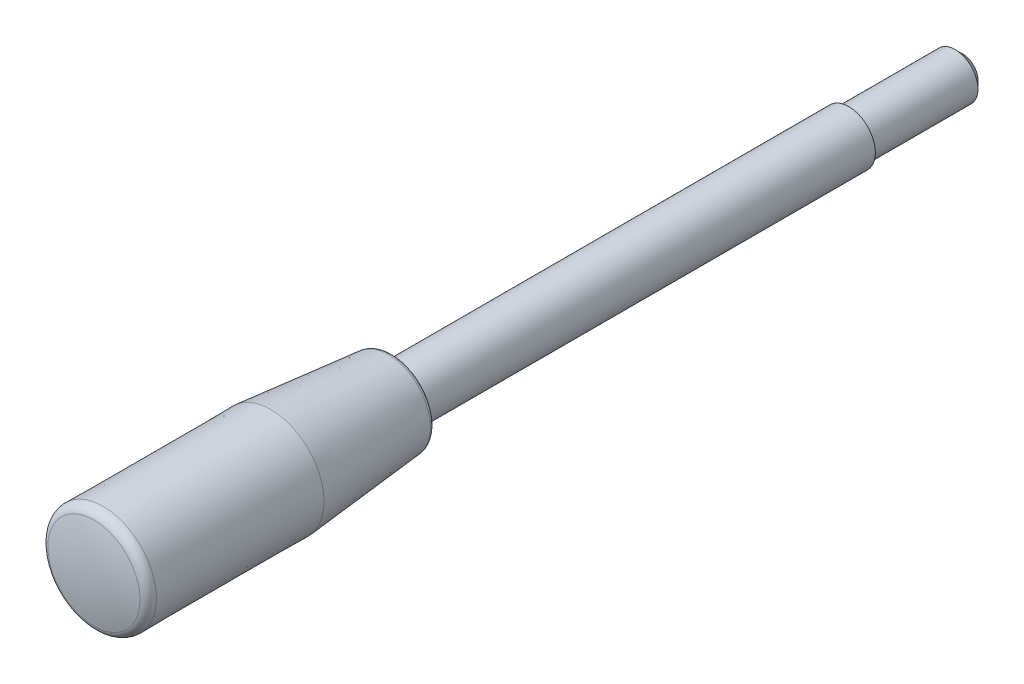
ISO-10303-21;
HEADER;
FILE_DESCRIPTION(('STEP AP214'),'2;1');
FILE_NAME('part.step','',(''),(''),'','','');
FILE_SCHEMA(('AUTOMOTIVE_DESIGN { 1 0 10303 214 1 1 1 1 }'));
ENDSEC;
DATA;
#1=APPLICATION_CONTEXT('core data for automotive mechanical design processes');
#2=APPLICATION_PROTOCOL_DEFINITION('international standard','automotive_design',2000,#1);
#3=PRODUCT_CONTEXT('',#1,'mechanical');
#4=PRODUCT('Part','Part','',(#3));
#5=PRODUCT_RELATED_PRODUCT_CATEGORY('part','',(#4));
#6=PRODUCT_DEFINITION_FORMATION('','',#4);
#7=PRODUCT_DEFINITION_CONTEXT('part definition',#1,'design');
#8=PRODUCT_DEFINITION('design','',#6,#7);
#9=PRODUCT_DEFINITION_SHAPE('','',#8);
#10=(LENGTH_UNIT() NAMED_UNIT(*) SI_UNIT(.MILLI.,.METRE.));
#11=(NAMED_UNIT(*) PLANE_ANGLE_UNIT() SI_UNIT($,.RADIAN.));
#12=(NAMED_UNIT(*) SI_UNIT($,.STERADIAN.) SOLID_ANGLE_UNIT());
#13=UNCERTAINTY_MEASURE_WITH_UNIT(LENGTH_MEASURE(1.E-05),#10,'distance_accuracy_value','');
#14=(GEOMETRIC_REPRESENTATION_CONTEXT(3) GLOBAL_UNCERTAINTY_ASSIGNED_CONTEXT((#13)) GLOBAL_UNIT_ASSIGNED_CONTEXT((#10,
#11,#12)) REPRESENTATION_CONTEXT('',''));
#15=CARTESIAN_POINT('',(0.,0.,0.));
#16=DIRECTION('',(0.,0.,1.));
#17=DIRECTION('',(1.,0.,0.));
#18=AXIS2_PLACEMENT_3D('',#15,#16,#17);
#19=CARTESIAN_POINT('',(0.,9.86172553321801,120.));
#20=DIRECTION('',(0.,0.,1.));
#21=DIRECTION('',(1.,0.,0.));
#22=AXIS2_PLACEMENT_3D('',#19,#20,#21);
#23=PLANE('',#22);
#24=CARTESIAN_POINT('',(0.,0.,120.));
#25=DIRECTION('',(0.,0.,-1.));
#26=DIRECTION('',(-1.,0.,0.));
#27=AXIS2_PLACEMENT_3D('',#24,#25,#26);
#28=CIRCLE('',#27,7.);
#29=CARTESIAN_POINT('',(-7.,0.,120.));
#30=VERTEX_POINT('',#29);
#31=EDGE_CURVE('E8',#30,#30,#28,.T.);
#32=ORIENTED_EDGE('',*,*,#31,.F.);
#33=EDGE_LOOP('',(#32));
#34=FACE_BOUND('',#33,.T.);
#35=CARTESIAN_POINT('',(0.,0.,120.));
#36=DIRECTION('',(0.,0.,-1.));
#37=DIRECTION('',(-1.,0.,0.));
#38=AXIS2_PLACEMENT_3D('',#35,#36,#37);
#39=CIRCLE('',#38,9.86172553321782);
#40=CARTESIAN_POINT('',(-9.86172553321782,0.,120.));
#41=VERTEX_POINT('',#40);
#42=EDGE_CURVE('E52',#41,#41,#39,.T.);
#43=ORIENTED_EDGE('',*,*,#42,.T.);
#44=EDGE_LOOP('',(#43));
#45=FACE_BOUND('',#44,.T.);
#46=ADVANCED_FACE('F12',(#34,#45),#23,.F.);
#47=CARTESIAN_POINT('',(0.,0.,-55.2954051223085));
#48=DIRECTION('',(0.,0.,-1.));
#49=DIRECTION('',(-1.,0.,0.));
#50=AXIS2_PLACEMENT_3D('',#47,#48,#49);
#51=CYLINDRICAL_SURFACE('',#50,7.);
#52=CARTESIAN_POINT('',(0.,0.,0.));
#53=DIRECTION('',(0.,0.,-1.));
#54=DIRECTION('',(-1.,0.,0.));
#55=AXIS2_PLACEMENT_3D('',#52,#53,#54);
#56=CIRCLE('',#55,7.);
#57=CARTESIAN_POINT('',(-7.,0.,0.));
#58=VERTEX_POINT('',#57);
#59=EDGE_CURVE('E18',#58,#58,#56,.T.);
#60=ORIENTED_EDGE('',*,*,#59,.F.);
#61=EDGE_LOOP('',(#60));
#62=FACE_BOUND('',#61,.T.);
#63=ORIENTED_EDGE('',*,*,#31,.T.);
#64=EDGE_LOOP('',(#63));
#65=FACE_BOUND('',#64,.T.);
#66=ADVANCED_FACE('F113',(#62,#65),#51,.T.);
#67=CARTESIAN_POINT('',(0.,7.,0.));
#68=DIRECTION('',(0.,0.,1.));
#69=DIRECTION('',(1.,0.,0.));
#70=AXIS2_PLACEMENT_3D('',#67,#68,#69);
#71=PLANE('',#70);
#72=CARTESIAN_POINT('',(0.,0.,0.));
#73=DIRECTION('',(0.,0.,-1.));
#74=DIRECTION('',(-1.,0.,0.));
#75=AXIS2_PLACEMENT_3D('',#72,#73,#74);
#76=CIRCLE('',#75,6.);
#77=CARTESIAN_POINT('',(-6.,0.,0.));
#78=VERTEX_POINT('',#77);
#79=EDGE_CURVE('E22',#78,#78,#76,.T.);
#80=ORIENTED_EDGE('',*,*,#79,.F.);
#81=EDGE_LOOP('',(#80));
#82=FACE_BOUND('',#81,.T.);
#83=ORIENTED_EDGE('',*,*,#59,.T.);
#84=EDGE_LOOP('',(#83));
#85=FACE_BOUND('',#84,.T.);
#86=ADVANCED_FACE('F108',(#82,#85),#71,.F.);
#87=CARTESIAN_POINT('',(0.,0.,-55.2954051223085));
#88=DIRECTION('',(0.,0.,-1.));
#89=DIRECTION('',(-1.,0.,0.));
#90=AXIS2_PLACEMENT_3D('',#87,#88,#89);
#91=CYLINDRICAL_SURFACE('',#90,6.);
#92=CARTESIAN_POINT('',(0.,0.,-28.000019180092));
#93=DIRECTION('',(0.,0.,-1.));
#94=DIRECTION('',(-1.,0.,0.));
#95=AXIS2_PLACEMENT_3D('',#92,#93,#94);
#96=CIRCLE('',#95,6.);
#97=CARTESIAN_POINT('',(-6.,0.,-28.000019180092));
#98=VERTEX_POINT('',#97);
#99=EDGE_CURVE('E26',#98,#98,#96,.T.);
#100=ORIENTED_EDGE('',*,*,#99,.F.);
#101=EDGE_LOOP('',(#100));
#102=FACE_BOUND('',#101,.T.);
#103=ORIENTED_EDGE('',*,*,#79,.T.);
#104=EDGE_LOOP('',(#103));
#105=FACE_BOUND('',#104,.T.);
#106=ADVANCED_FACE('F102',(#102,#105),#91,.T.);
#107=CARTESIAN_POINT('',(0.,0.,-28.000019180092));
#108=DIRECTION('',(0.,0.,1.));
#109=DIRECTION('',(1.,0.,0.));
#110=AXIS2_PLACEMENT_3D('',#107,#108,#109);
#111=CONICAL_SURFACE('',#110,6.,0.785398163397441);
#112=CARTESIAN_POINT('',(0.,0.,-30.));
#113=DIRECTION('',(0.,0.,-1.));
#114=DIRECTION('',(-1.,0.,0.));
#115=AXIS2_PLACEMENT_3D('',#112,#113,#114);
#116=CIRCLE('',#115,4.00001918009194);
#117=CARTESIAN_POINT('',(-4.00001918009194,0.,-30.));
#118=VERTEX_POINT('',#117);
#119=EDGE_CURVE('E31',#118,#118,#116,.T.);
#120=ORIENTED_EDGE('',*,*,#119,.F.);
#121=EDGE_LOOP('',(#120));
#122=FACE_BOUND('',#121,.T.);
#123=ORIENTED_EDGE('',*,*,#99,.T.);
#124=EDGE_LOOP('',(#123));
#125=FACE_BOUND('',#124,.T.);
#126=ADVANCED_FACE('F96',(#122,#125),#111,.T.);
#127=CARTESIAN_POINT('',(0.,4.00001918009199,-30.));
#128=DIRECTION('',(0.,0.,1.));
#129=DIRECTION('',(1.,0.,0.));
#130=AXIS2_PLACEMENT_3D('',#127,#128,#129);
#131=PLANE('',#130);
#132=CARTESIAN_POINT('',(0.,0.,-30.));
#133=DIRECTION('',(0.,0.,-1.));
#134=DIRECTION('',(-1.,0.,0.));
#135=AXIS2_PLACEMENT_3D('',#132,#133,#134);
#136=CIRCLE('',#135,1.91800919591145E-05);
#137=CARTESIAN_POINT('',(-1.91800919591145E-05,0.,-30.));
#138=VERTEX_POINT('',#137);
#139=EDGE_CURVE('E34',#138,#138,#136,.T.);
#140=ORIENTED_EDGE('',*,*,#139,.F.);
#141=EDGE_LOOP('',(#140));
#142=FACE_BOUND('',#141,.T.);
#143=ORIENTED_EDGE('',*,*,#119,.T.);
#144=EDGE_LOOP('',(#143));
#145=FACE_BOUND('',#144,.T.);
#146=ADVANCED_FACE('F90',(#142,#145),#131,.F.);
#147=CARTESIAN_POINT('',(0.,0.,-55.2954051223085));
#148=DIRECTION('',(0.,0.,-1.));
#149=DIRECTION('',(-1.,0.,0.));
#150=AXIS2_PLACEMENT_3D('',#147,#148,#149);
#151=CYLINDRICAL_SURFACE('',#150,1.91800919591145E-05);
#152=CARTESIAN_POINT('',(0.,0.,200.));
#153=DIRECTION('',(0.,0.,-1.));
#154=DIRECTION('',(-1.,0.,0.));
#155=AXIS2_PLACEMENT_3D('',#152,#153,#154);
#156=CIRCLE('',#155,1.91800919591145E-05);
#157=CARTESIAN_POINT('',(-1.91800919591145E-05,0.,200.));
#158=VERTEX_POINT('',#157);
#159=EDGE_CURVE('E37',#158,#158,#156,.T.);
#160=ORIENTED_EDGE('',*,*,#159,.F.);
#161=EDGE_LOOP('',(#160));
#162=FACE_BOUND('',#161,.T.);
#163=ORIENTED_EDGE('',*,*,#139,.T.);
#164=EDGE_LOOP('',(#163));
#165=FACE_BOUND('',#164,.T.);
#166=ADVANCED_FACE('F84',(#162,#165),#151,.F.);
#167=CARTESIAN_POINT('',(0.,0.,150.0000000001));
#168=DIRECTION('',(0.,0.,-1.));
#169=DIRECTION('',(-1.,0.,0.));
#170=AXIS2_PLACEMENT_3D('',#167,#168,#169);
#171=DEGENERATE_TOROIDAL_SURFACE('',#170,8.12240993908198E-05,50.,.F.);
#172=CARTESIAN_POINT('',(0.,0.,198.512478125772));
#173=DIRECTION('',(0.,0.,-1.));
#174=DIRECTION('',(-1.,0.,0.));
#175=AXIS2_PLACEMENT_3D('',#172,#173,#174);
#176=CIRCLE('',#175,12.1052674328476);
#177=CARTESIAN_POINT('',(-12.1052674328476,0.,198.512478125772));
#178=VERTEX_POINT('',#177);
#179=EDGE_CURVE('E40',#178,#178,#176,.T.);
#180=ORIENTED_EDGE('',*,*,#179,.F.);
#181=EDGE_LOOP('',(#180));
#182=FACE_BOUND('',#181,.T.);
#183=ORIENTED_EDGE('',*,*,#159,.T.);
#184=EDGE_LOOP('',(#183));
#185=FACE_BOUND('',#184,.T.);
#186=ADVANCED_FACE('F78',(#182,#185),#171,.F.);
#187=CARTESIAN_POINT('',(0.,0.,196.086854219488));
#188=DIRECTION('',(0.,0.,-1.));
#189=DIRECTION('',(-1.,0.,0.));
#190=AXIS2_PLACEMENT_3D('',#187,#188,#189);
#191=TOROIDAL_SURFACE('',#190,11.5000000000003,2.49999999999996);
#192=CARTESIAN_POINT('',(0.,0.,196.086855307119));
#193=DIRECTION('',(0.,0.,-1.));
#194=DIRECTION('',(-1.,0.,0.));
#195=AXIS2_PLACEMENT_3D('',#192,#193,#194);
#196=CIRCLE('',#195,14.);
#197=CARTESIAN_POINT('',(-14.,0.,196.086855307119));
#198=VERTEX_POINT('',#197);
#199=EDGE_CURVE('E43',#198,#198,#196,.T.);
#200=ORIENTED_EDGE('',*,*,#199,.F.);
#201=EDGE_LOOP('',(#200));
#202=FACE_BOUND('',#201,.T.);
#203=ORIENTED_EDGE('',*,*,#179,.T.);
#204=EDGE_LOOP('',(#203));
#205=FACE_BOUND('',#204,.T.);
#206=ADVANCED_FACE('F72',(#202,#205),#191,.T.);
#207=CARTESIAN_POINT('',(0.,0.,196.086855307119));
#208=DIRECTION('',(0.,0.,-1.));
#209=DIRECTION('',(-1.,0.,0.));
#210=AXIS2_PLACEMENT_3D('',#207,#208,#209);
#211=CONICAL_SURFACE('',#210,14.,4.35052393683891E-07);
#212=CARTESIAN_POINT('',(0.,0.,152.));
#213=DIRECTION('',(0.,0.,-1.));
#214=DIRECTION('',(-1.,0.,0.));
#215=AXIS2_PLACEMENT_3D('',#212,#213,#214);
#216=CIRCLE('',#215,14.0000191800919);
#217=CARTESIAN_POINT('',(-14.0000191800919,0.,152.));
#218=VERTEX_POINT('',#217);
#219=EDGE_CURVE('E46',#218,#218,#216,.T.);
#220=ORIENTED_EDGE('',*,*,#219,.F.);
#221=EDGE_LOOP('',(#220));
#222=FACE_BOUND('',#221,.T.);
#223=ORIENTED_EDGE('',*,*,#199,.T.);
#224=EDGE_LOOP('',(#223));
#225=FACE_BOUND('',#224,.T.);
#226=ADVANCED_FACE('F66',(#222,#225),#211,.T.);
#227=CARTESIAN_POINT('',(0.,0.,152.));
#228=DIRECTION('',(0.,0.,1.));
#229=DIRECTION('',(1.,0.,0.));
#230=AXIS2_PLACEMENT_3D('',#227,#228,#229);
#231=CONICAL_SURFACE('',#230,14.0000191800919,0.0934767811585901);
#232=CARTESIAN_POINT('',(0.,0.,121.133324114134));
#233=DIRECTION('',(0.,0.,-1.));
#234=DIRECTION('',(-1.,0.,0.));
#235=AXIS2_PLACEMENT_3D('',#232,#233,#234);
#236=CIRCLE('',#235,11.1062683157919);
#237=CARTESIAN_POINT('',(-11.1062683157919,0.,121.133324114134));
#238=VERTEX_POINT('',#237);
#239=EDGE_CURVE('E49',#238,#238,#236,.T.);
#240=ORIENTED_EDGE('',*,*,#239,.F.);
#241=EDGE_LOOP('',(#240));
#242=FACE_BOUND('',#241,.T.);
#243=ORIENTED_EDGE('',*,*,#219,.T.);
#244=EDGE_LOOP('',(#243));
#245=FACE_BOUND('',#244,.T.);
#246=ADVANCED_FACE('F60',(#242,#245),#231,.T.);
#247=CARTESIAN_POINT('',(0.,0.,121.25));
#248=DIRECTION('',(0.,0.,-1.));
#249=DIRECTION('',(-1.,0.,0.));
#250=AXIS2_PLACEMENT_3D('',#247,#248,#249);
#251=TOROIDAL_SURFACE('',#250,9.86172553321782,1.25);
#252=ORIENTED_EDGE('',*,*,#42,.F.);
#253=EDGE_LOOP('',(#252));
#254=FACE_BOUND('',#253,.T.);
#255=ORIENTED_EDGE('',*,*,#239,.T.);
#256=EDGE_LOOP('',(#255));
#257=FACE_BOUND('',#256,.T.);
#258=ADVANCED_FACE('F57',(#254,#257),#251,.T.);
#259=CLOSED_SHELL('',(#46,#66,#86,#106,#126,#146,#166,#186,#206,#226,#246,#258));
#260=MANIFOLD_SOLID_BREP('B1',#259);
#261=ADVANCED_BREP_SHAPE_REPRESENTATION('',(#18,#260),#14);
#262=SHAPE_DEFINITION_REPRESENTATION(#9,#261);
ENDSEC;
END-ISO-10303-21;
